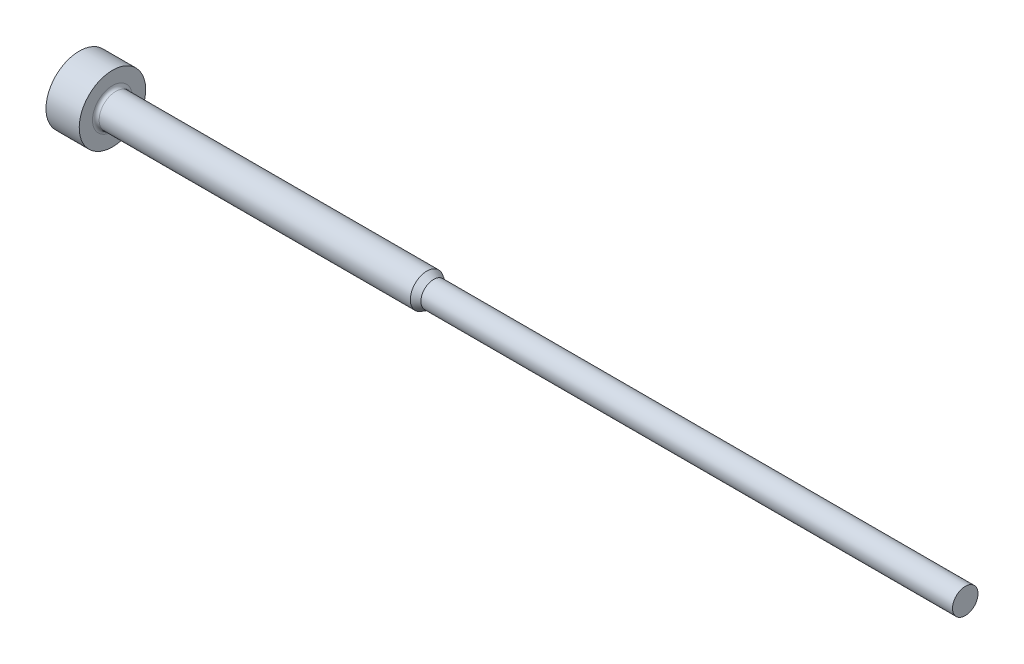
ISO-10303-21;
HEADER;
FILE_DESCRIPTION(('STEP AP214'),'2;1');
FILE_NAME('part.step','',(''),(''),'','','');
FILE_SCHEMA(('AUTOMOTIVE_DESIGN { 1 0 10303 214 1 1 1 1 }'));
ENDSEC;
DATA;
#1=APPLICATION_CONTEXT('core data for automotive mechanical design processes');
#2=APPLICATION_PROTOCOL_DEFINITION('international standard','automotive_design',2000,#1);
#3=PRODUCT_CONTEXT('',#1,'mechanical');
#4=PRODUCT('Part','Part','',(#3));
#5=PRODUCT_RELATED_PRODUCT_CATEGORY('part','',(#4));
#6=PRODUCT_DEFINITION_FORMATION('','',#4);
#7=PRODUCT_DEFINITION_CONTEXT('part definition',#1,'design');
#8=PRODUCT_DEFINITION('design','',#6,#7);
#9=PRODUCT_DEFINITION_SHAPE('','',#8);
#10=(LENGTH_UNIT() NAMED_UNIT(*) SI_UNIT(.MILLI.,.METRE.));
#11=(NAMED_UNIT(*) PLANE_ANGLE_UNIT() SI_UNIT($,.RADIAN.));
#12=(NAMED_UNIT(*) SI_UNIT($,.STERADIAN.) SOLID_ANGLE_UNIT());
#13=UNCERTAINTY_MEASURE_WITH_UNIT(LENGTH_MEASURE(1.E-05),#10,'distance_accuracy_value','');
#14=(GEOMETRIC_REPRESENTATION_CONTEXT(3) GLOBAL_UNCERTAINTY_ASSIGNED_CONTEXT((#13)) GLOBAL_UNIT_ASSIGNED_CONTEXT((#10,
#11,#12)) REPRESENTATION_CONTEXT('',''));
#15=CARTESIAN_POINT('',(0.,0.,0.));
#16=DIRECTION('',(0.,0.,1.));
#17=DIRECTION('',(1.,0.,0.));
#18=AXIS2_PLACEMENT_3D('',#15,#16,#17);
#19=CARTESIAN_POINT('',(0.,0.,0.));
#20=DIRECTION('',(1.,0.,0.));
#21=DIRECTION('',(0.,1.,0.));
#22=AXIS2_PLACEMENT_3D('',#19,#20,#21);
#23=PLANE('',#22);
#24=CARTESIAN_POINT('',(0.,0.,0.));
#25=DIRECTION('',(-1.,0.,0.));
#26=DIRECTION('',(0.,-1.,0.));
#27=AXIS2_PLACEMENT_3D('',#24,#25,#26);
#28=CIRCLE('',#27,3.);
#29=CARTESIAN_POINT('',(0.,-3.,0.));
#30=VERTEX_POINT('',#29);
#31=EDGE_CURVE('E25',#30,#30,#28,.T.);
#32=ORIENTED_EDGE('',*,*,#31,.T.);
#33=EDGE_LOOP('',(#32));
#34=FACE_BOUND('',#33,.T.);
#35=ADVANCED_FACE('F14',(#34),#23,.F.);
#36=CARTESIAN_POINT('',(0.,0.,0.));
#37=DIRECTION('',(-1.,0.,0.));
#38=DIRECTION('',(0.,-1.,0.));
#39=AXIS2_PLACEMENT_3D('',#36,#37,#38);
#40=CYLINDRICAL_SURFACE('',#39,3.);
#41=ORIENTED_EDGE('',*,*,#31,.F.);
#42=EDGE_LOOP('',(#41));
#43=FACE_BOUND('',#42,.T.);
#44=CARTESIAN_POINT('',(3.,0.,0.));
#45=DIRECTION('',(-1.,0.,0.));
#46=DIRECTION('',(0.,-1.,0.));
#47=AXIS2_PLACEMENT_3D('',#44,#45,#46);
#48=CIRCLE('',#47,3.);
#49=CARTESIAN_POINT('',(3.,-3.,0.));
#50=VERTEX_POINT('',#49);
#51=EDGE_CURVE('E29',#50,#50,#48,.T.);
#52=ORIENTED_EDGE('',*,*,#51,.T.);
#53=EDGE_LOOP('',(#52));
#54=FACE_BOUND('',#53,.T.);
#55=ADVANCED_FACE('F60',(#43,#54),#40,.T.);
#56=CARTESIAN_POINT('',(3.,3.,0.));
#57=DIRECTION('',(-1.,0.,0.));
#58=DIRECTION('',(0.,-1.,0.));
#59=AXIS2_PLACEMENT_3D('',#56,#57,#58);
#60=PLANE('',#59);
#61=CARTESIAN_POINT('',(3.,0.,0.));
#62=DIRECTION('',(-1.,0.,0.));
#63=DIRECTION('',(0.,-1.,0.));
#64=AXIS2_PLACEMENT_3D('',#61,#62,#63);
#65=CIRCLE('',#64,1.8);
#66=CARTESIAN_POINT('',(3.,-1.8,0.));
#67=VERTEX_POINT('',#66);
#68=EDGE_CURVE('E21',#67,#67,#65,.T.);
#69=ORIENTED_EDGE('',*,*,#68,.T.);
#70=EDGE_LOOP('',(#69));
#71=FACE_BOUND('',#70,.T.);
#72=ORIENTED_EDGE('',*,*,#51,.F.);
#73=EDGE_LOOP('',(#72));
#74=FACE_BOUND('',#73,.T.);
#75=ADVANCED_FACE('F66',(#71,#74),#60,.F.);
#76=CARTESIAN_POINT('',(0.,0.,0.));
#77=DIRECTION('',(-1.,0.,0.));
#78=DIRECTION('',(0.,-1.,0.));
#79=AXIS2_PLACEMENT_3D('',#76,#77,#78);
#80=CYLINDRICAL_SURFACE('',#79,1.49999999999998);
#81=CARTESIAN_POINT('',(3.3,0.,0.));
#82=DIRECTION('',(-1.,0.,0.));
#83=DIRECTION('',(0.,-1.,0.));
#84=AXIS2_PLACEMENT_3D('',#81,#82,#83);
#85=CIRCLE('',#84,1.49999999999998);
#86=CARTESIAN_POINT('',(3.3,-1.49999999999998,0.));
#87=VERTEX_POINT('',#86);
#88=EDGE_CURVE('E9',#87,#87,#85,.F.);
#89=ORIENTED_EDGE('',*,*,#88,.T.);
#90=EDGE_LOOP('',(#89));
#91=FACE_BOUND('',#90,.T.);
#92=CARTESIAN_POINT('',(31.3937822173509,0.,0.));
#93=DIRECTION('',(-1.,0.,0.));
#94=DIRECTION('',(0.,-1.,0.));
#95=AXIS2_PLACEMENT_3D('',#92,#93,#94);
#96=CIRCLE('',#95,1.49999999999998);
#97=CARTESIAN_POINT('',(31.3937822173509,-1.49999999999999,0.));
#98=VERTEX_POINT('',#97);
#99=EDGE_CURVE('E34',#98,#98,#96,.T.);
#100=ORIENTED_EDGE('',*,*,#99,.T.);
#101=EDGE_LOOP('',(#100));
#102=FACE_BOUND('',#101,.T.);
#103=ADVANCED_FACE('F72',(#91,#102),#80,.T.);
#104=CARTESIAN_POINT('',(32.,0.,0.));
#105=DIRECTION('',(-1.,0.,0.));
#106=DIRECTION('',(0.,-1.,0.));
#107=AXIS2_PLACEMENT_3D('',#104,#105,#106);
#108=CONICAL_SURFACE('',#107,1.15,0.523598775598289);
#109=ORIENTED_EDGE('',*,*,#99,.F.);
#110=EDGE_LOOP('',(#109));
#111=FACE_BOUND('',#110,.T.);
#112=CARTESIAN_POINT('',(32.,0.,0.));
#113=DIRECTION('',(-1.,0.,0.));
#114=DIRECTION('',(0.,-1.,0.));
#115=AXIS2_PLACEMENT_3D('',#112,#113,#114);
#116=CIRCLE('',#115,1.15);
#117=CARTESIAN_POINT('',(32.,-1.15000000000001,0.));
#118=VERTEX_POINT('',#117);
#119=EDGE_CURVE('E37',#118,#118,#116,.T.);
#120=ORIENTED_EDGE('',*,*,#119,.T.);
#121=EDGE_LOOP('',(#120));
#122=FACE_BOUND('',#121,.T.);
#123=ADVANCED_FACE('F56',(#111,#122),#108,.T.);
#124=CARTESIAN_POINT('',(0.,0.,0.));
#125=DIRECTION('',(-1.,0.,0.));
#126=DIRECTION('',(0.,-1.,0.));
#127=AXIS2_PLACEMENT_3D('',#124,#125,#126);
#128=CYLINDRICAL_SURFACE('',#127,1.15);
#129=ORIENTED_EDGE('',*,*,#119,.F.);
#130=EDGE_LOOP('',(#129));
#131=FACE_BOUND('',#130,.T.);
#132=CARTESIAN_POINT('',(80.,0.,0.));
#133=DIRECTION('',(-1.,0.,0.));
#134=DIRECTION('',(0.,-1.,0.));
#135=AXIS2_PLACEMENT_3D('',#132,#133,#134);
#136=CIRCLE('',#135,1.15);
#137=CARTESIAN_POINT('',(80.,-1.15000000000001,0.));
#138=VERTEX_POINT('',#137);
#139=EDGE_CURVE('E40',#138,#138,#136,.T.);
#140=ORIENTED_EDGE('',*,*,#139,.T.);
#141=EDGE_LOOP('',(#140));
#142=FACE_BOUND('',#141,.T.);
#143=ADVANCED_FACE('F44',(#131,#142),#128,.T.);
#144=CARTESIAN_POINT('',(80.,1.14999999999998,0.));
#145=DIRECTION('',(-1.,0.,0.));
#146=DIRECTION('',(0.,-1.,0.));
#147=AXIS2_PLACEMENT_3D('',#144,#145,#146);
#148=PLANE('',#147);
#149=ORIENTED_EDGE('',*,*,#139,.F.);
#150=EDGE_LOOP('',(#149));
#151=FACE_BOUND('',#150,.T.);
#152=ADVANCED_FACE('F46',(#151),#148,.F.);
#153=CARTESIAN_POINT('',(3.3,0.,0.));
#154=DIRECTION('',(-1.,0.,0.));
#155=DIRECTION('',(0.,-1.,0.));
#156=AXIS2_PLACEMENT_3D('',#153,#154,#155);
#157=TOROIDAL_SURFACE('',#156,1.8,0.3);
#158=ORIENTED_EDGE('',*,*,#88,.F.);
#159=EDGE_LOOP('',(#158));
#160=FACE_BOUND('',#159,.T.);
#161=ORIENTED_EDGE('',*,*,#68,.F.);
#162=EDGE_LOOP('',(#161));
#163=FACE_BOUND('',#162,.T.);
#164=ADVANCED_FACE('F16',(#160,#163),#157,.F.);
#165=CLOSED_SHELL('',(#35,#55,#75,#103,#123,#143,#152,#164));
#166=MANIFOLD_SOLID_BREP('B1',#165);
#167=ADVANCED_BREP_SHAPE_REPRESENTATION('',(#18,#166),#14);
#168=SHAPE_DEFINITION_REPRESENTATION(#9,#167);
ENDSEC;
END-ISO-10303-21;
